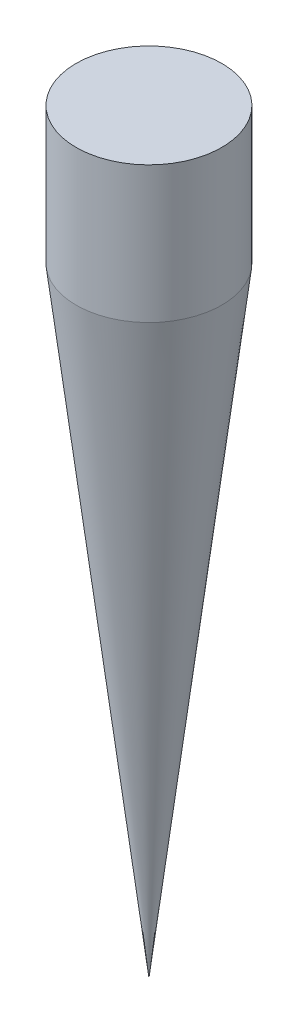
ISO-10303-21;
HEADER;
FILE_DESCRIPTION(('STEP AP214'),'2;1');
FILE_NAME('part.step','',(''),(''),'','','');
FILE_SCHEMA(('AUTOMOTIVE_DESIGN { 1 0 10303 214 1 1 1 1 }'));
ENDSEC;
DATA;
#1=APPLICATION_CONTEXT('core data for automotive mechanical design processes');
#2=APPLICATION_PROTOCOL_DEFINITION('international standard','automotive_design',2000,#1);
#3=PRODUCT_CONTEXT('',#1,'mechanical');
#4=PRODUCT('Part','Part','',(#3));
#5=PRODUCT_RELATED_PRODUCT_CATEGORY('part','',(#4));
#6=PRODUCT_DEFINITION_FORMATION('','',#4);
#7=PRODUCT_DEFINITION_CONTEXT('part definition',#1,'design');
#8=PRODUCT_DEFINITION('design','',#6,#7);
#9=PRODUCT_DEFINITION_SHAPE('','',#8);
#10=(LENGTH_UNIT() NAMED_UNIT(*) SI_UNIT(.MILLI.,.METRE.));
#11=(NAMED_UNIT(*) PLANE_ANGLE_UNIT() SI_UNIT($,.RADIAN.));
#12=(NAMED_UNIT(*) SI_UNIT($,.STERADIAN.) SOLID_ANGLE_UNIT());
#13=UNCERTAINTY_MEASURE_WITH_UNIT(LENGTH_MEASURE(1.E-05),#10,'distance_accuracy_value','');
#14=(GEOMETRIC_REPRESENTATION_CONTEXT(3) GLOBAL_UNCERTAINTY_ASSIGNED_CONTEXT((#13)) GLOBAL_UNIT_ASSIGNED_CONTEXT((#10,
#11,#12)) REPRESENTATION_CONTEXT('',''));
#15=CARTESIAN_POINT('',(0.,0.,0.));
#16=DIRECTION('',(0.,0.,1.));
#17=DIRECTION('',(1.,0.,0.));
#18=AXIS2_PLACEMENT_3D('',#15,#16,#17);
#19=CARTESIAN_POINT('',(0.,-34.,0.));
#20=DIRECTION('',(0.,1.,0.));
#21=DIRECTION('',(-1.,0.,0.));
#22=AXIS2_PLACEMENT_3D('',#19,#20,#21);
#23=CONICAL_SURFACE('',#22,0.,0.117108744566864);
#24=CARTESIAN_POINT('',(0.,0.,0.));
#25=DIRECTION('',(0.,1.,0.));
#26=DIRECTION('',(-1.,0.,0.));
#27=AXIS2_PLACEMENT_3D('',#24,#25,#26);
#28=CIRCLE('',#27,4.);
#29=CARTESIAN_POINT('',(-4.,0.,0.));
#30=VERTEX_POINT('',#29);
#31=EDGE_CURVE('E11',#30,#30,#28,.T.);
#32=ORIENTED_EDGE('',*,*,#31,.F.);
#33=EDGE_LOOP('',(#32));
#34=FACE_BOUND('',#33,.T.);
#35=CARTESIAN_POINT('',(0.,-34.,0.));
#36=VERTEX_POINT('',#35);
#37=VERTEX_LOOP('',#36);
#38=FACE_BOUND('',#37,.T.);
#39=ADVANCED_FACE('F36',(#34,#38),#23,.T.);
#40=CARTESIAN_POINT('',(0.,7.5,0.));
#41=DIRECTION('',(0.,-1.,0.));
#42=DIRECTION('',(1.,0.,0.));
#43=AXIS2_PLACEMENT_3D('',#40,#41,#42);
#44=CYLINDRICAL_SURFACE('',#43,4.);
#45=CARTESIAN_POINT('',(0.,7.5,0.));
#46=DIRECTION('',(0.,1.,0.));
#47=DIRECTION('',(-1.,0.,0.));
#48=AXIS2_PLACEMENT_3D('',#45,#46,#47);
#49=CIRCLE('',#48,4.);
#50=CARTESIAN_POINT('',(-4.,7.5,0.));
#51=VERTEX_POINT('',#50);
#52=EDGE_CURVE('E42',#51,#51,#49,.T.);
#53=ORIENTED_EDGE('',*,*,#52,.F.);
#54=EDGE_LOOP('',(#53));
#55=FACE_BOUND('',#54,.T.);
#56=ORIENTED_EDGE('',*,*,#31,.T.);
#57=EDGE_LOOP('',(#56));
#58=FACE_BOUND('',#57,.T.);
#59=ADVANCED_FACE('F46',(#55,#58),#44,.T.);
#60=CARTESIAN_POINT('',(0.,7.5,0.));
#61=DIRECTION('',(0.,1.,0.));
#62=DIRECTION('',(-1.,0.,0.));
#63=AXIS2_PLACEMENT_3D('',#60,#61,#62);
#64=PLANE('',#63);
#65=ORIENTED_EDGE('',*,*,#52,.T.);
#66=EDGE_LOOP('',(#65));
#67=FACE_BOUND('',#66,.T.);
#68=ADVANCED_FACE('F51',(#67),#64,.T.);
#69=CLOSED_SHELL('',(#39,#59,#68));
#70=MANIFOLD_SOLID_BREP('B2',#69);
#71=ADVANCED_BREP_SHAPE_REPRESENTATION('',(#18,#70),#14);
#72=SHAPE_DEFINITION_REPRESENTATION(#9,#71);
ENDSEC;
END-ISO-10303-21;
